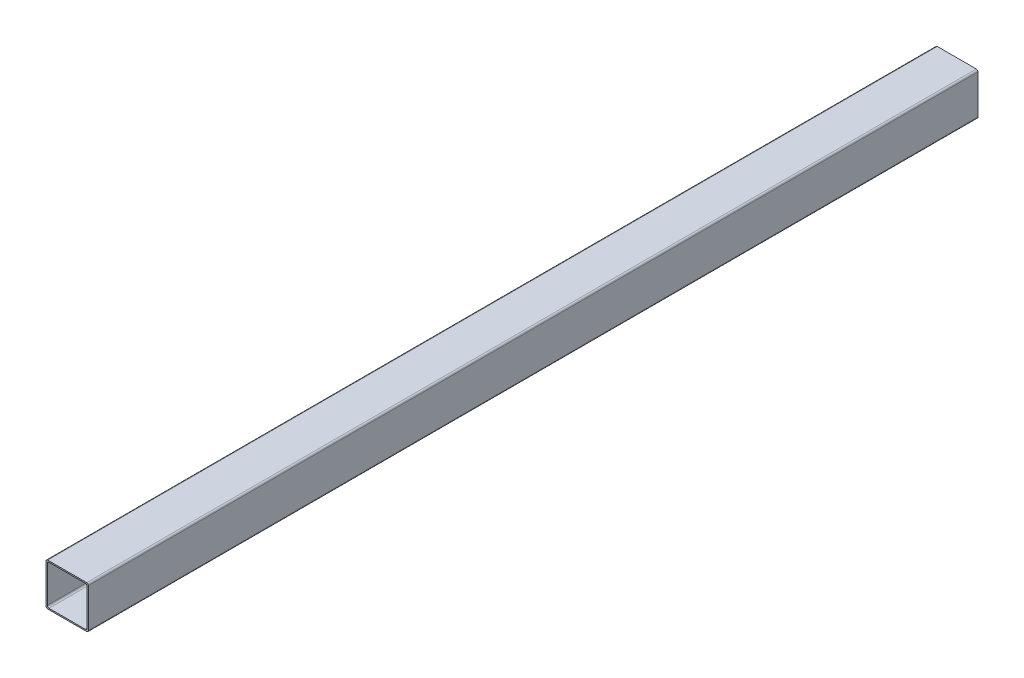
ISO-10303-21;
HEADER;
FILE_DESCRIPTION(('STEP AP214'),'2;1');
FILE_NAME('part.step','',(''),(''),'','','');
FILE_SCHEMA(('AUTOMOTIVE_DESIGN { 1 0 10303 214 1 1 1 1 }'));
ENDSEC;
DATA;
#1=APPLICATION_CONTEXT('core data for automotive mechanical design processes');
#2=APPLICATION_PROTOCOL_DEFINITION('international standard','automotive_design',2000,#1);
#3=PRODUCT_CONTEXT('',#1,'mechanical');
#4=PRODUCT('Part','Part','',(#3));
#5=PRODUCT_RELATED_PRODUCT_CATEGORY('part','',(#4));
#6=PRODUCT_DEFINITION_FORMATION('','',#4);
#7=PRODUCT_DEFINITION_CONTEXT('part definition',#1,'design');
#8=PRODUCT_DEFINITION('design','',#6,#7);
#9=PRODUCT_DEFINITION_SHAPE('','',#8);
#10=(LENGTH_UNIT() NAMED_UNIT(*) SI_UNIT(.MILLI.,.METRE.));
#11=(NAMED_UNIT(*) PLANE_ANGLE_UNIT() SI_UNIT($,.RADIAN.));
#12=(NAMED_UNIT(*) SI_UNIT($,.STERADIAN.) SOLID_ANGLE_UNIT());
#13=UNCERTAINTY_MEASURE_WITH_UNIT(LENGTH_MEASURE(1.E-05),#10,'distance_accuracy_value','');
#14=(GEOMETRIC_REPRESENTATION_CONTEXT(3) GLOBAL_UNCERTAINTY_ASSIGNED_CONTEXT((#13)) GLOBAL_UNIT_ASSIGNED_CONTEXT((#10,
#11,#12)) REPRESENTATION_CONTEXT('',''));
#15=CARTESIAN_POINT('',(0.,0.,0.));
#16=DIRECTION('',(0.,0.,1.));
#17=DIRECTION('',(1.,0.,0.));
#18=AXIS2_PLACEMENT_3D('',#15,#16,#17);
#19=CARTESIAN_POINT('',(0.,0.,2100.00000000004));
#20=DIRECTION('',(0.,0.,1.));
#21=DIRECTION('',(1.,0.,0.));
#22=AXIS2_PLACEMENT_3D('',#19,#20,#21);
#23=PLANE('',#22);
#24=DIRECTION('',(1.,0.,0.));
#25=VECTOR('',#24,1.);
#26=CARTESIAN_POINT('',(0.,0.,2100.00000000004));
#27=LINE('',#26,#25);
#28=CARTESIAN_POINT('',(4.,0.,2100.00000000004));
#29=VERTEX_POINT('',#28);
#30=CARTESIAN_POINT('',(96.,0.,2100.00000000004));
#31=VERTEX_POINT('',#30);
#32=EDGE_CURVE('E355',#29,#31,#27,.T.);
#33=ORIENTED_EDGE('',*,*,#32,.T.);
#34=CARTESIAN_POINT('',(96.,4.,2100.00000000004));
#35=DIRECTION('',(0.,0.,1.));
#36=DIRECTION('',(1.,0.,0.));
#37=AXIS2_PLACEMENT_3D('',#34,#35,#36);
#38=CIRCLE('',#37,4.);
#39=CARTESIAN_POINT('',(100.,4.,2100.00000000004));
#40=VERTEX_POINT('',#39);
#41=EDGE_CURVE('E256',#31,#40,#38,.T.);
#42=ORIENTED_EDGE('',*,*,#41,.T.);
#43=DIRECTION('',(0.,1.,0.));
#44=VECTOR('',#43,1.);
#45=CARTESIAN_POINT('',(100.,0.,2100.00000000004));
#46=LINE('',#45,#44);
#47=CARTESIAN_POINT('',(100.,96.,2100.00000000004));
#48=VERTEX_POINT('',#47);
#49=EDGE_CURVE('E217',#40,#48,#46,.T.);
#50=ORIENTED_EDGE('',*,*,#49,.T.);
#51=CARTESIAN_POINT('',(96.,96.,2100.00000000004));
#52=DIRECTION('',(0.,0.,1.));
#53=DIRECTION('',(1.,0.,0.));
#54=AXIS2_PLACEMENT_3D('',#51,#52,#53);
#55=CIRCLE('',#54,4.);
#56=CARTESIAN_POINT('',(96.,100.,2100.00000000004));
#57=VERTEX_POINT('',#56);
#58=EDGE_CURVE('E247',#48,#57,#55,.T.);
#59=ORIENTED_EDGE('',*,*,#58,.T.);
#60=DIRECTION('',(-1.,0.,0.));
#61=VECTOR('',#60,1.);
#62=CARTESIAN_POINT('',(0.,100.,2100.00000000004));
#63=LINE('',#62,#61);
#64=CARTESIAN_POINT('',(4.,100.,2100.00000000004));
#65=VERTEX_POINT('',#64);
#66=EDGE_CURVE('E236',#57,#65,#63,.T.);
#67=ORIENTED_EDGE('',*,*,#66,.T.);
#68=CARTESIAN_POINT('',(4.,96.,2100.00000000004));
#69=DIRECTION('',(0.,0.,1.));
#70=DIRECTION('',(1.,0.,0.));
#71=AXIS2_PLACEMENT_3D('',#68,#69,#70);
#72=CIRCLE('',#71,4.);
#73=CARTESIAN_POINT('',(0.,96.,2100.00000000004));
#74=VERTEX_POINT('',#73);
#75=EDGE_CURVE('E250',#65,#74,#72,.T.);
#76=ORIENTED_EDGE('',*,*,#75,.T.);
#77=DIRECTION('',(0.,-1.,0.));
#78=VECTOR('',#77,1.);
#79=CARTESIAN_POINT('',(0.,0.,2100.00000000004));
#80=LINE('',#79,#78);
#81=CARTESIAN_POINT('',(0.,4.,2100.00000000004));
#82=VERTEX_POINT('',#81);
#83=EDGE_CURVE('E229',#74,#82,#80,.T.);
#84=ORIENTED_EDGE('',*,*,#83,.T.);
#85=CARTESIAN_POINT('',(4.,4.,2100.00000000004));
#86=DIRECTION('',(0.,0.,1.));
#87=DIRECTION('',(1.,0.,0.));
#88=AXIS2_PLACEMENT_3D('',#85,#86,#87);
#89=CIRCLE('',#88,4.);
#90=EDGE_CURVE('E253',#82,#29,#89,.T.);
#91=ORIENTED_EDGE('',*,*,#90,.T.);
#92=EDGE_LOOP('',(#33,#42,#50,#59,#67,#76,#84,#91));
#93=FACE_BOUND('',#92,.T.);
#94=DIRECTION('',(1.,0.,0.));
#95=VECTOR('',#94,1.);
#96=CARTESIAN_POINT('',(0.,3.,2100.00000000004));
#97=LINE('',#96,#95);
#98=CARTESIAN_POINT('',(7.,3.,2100.00000000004));
#99=VERTEX_POINT('',#98);
#100=CARTESIAN_POINT('',(93.,3.,2100.00000000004));
#101=VERTEX_POINT('',#100);
#102=EDGE_CURVE('E342',#99,#101,#97,.T.);
#103=ORIENTED_EDGE('',*,*,#102,.F.);
#104=CARTESIAN_POINT('',(7.,7.00000000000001,2100.00000000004));
#105=DIRECTION('',(0.,0.,1.));
#106=DIRECTION('',(1.,0.,0.));
#107=AXIS2_PLACEMENT_3D('',#104,#105,#106);
#108=CIRCLE('',#107,4.);
#109=CARTESIAN_POINT('',(3.,7.00000000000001,2100.00000000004));
#110=VERTEX_POINT('',#109);
#111=EDGE_CURVE('E302',#99,#110,#108,.F.);
#112=ORIENTED_EDGE('',*,*,#111,.T.);
#113=DIRECTION('',(0.,-1.,0.));
#114=VECTOR('',#113,1.);
#115=CARTESIAN_POINT('',(3.,100.,2100.00000000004));
#116=LINE('',#115,#114);
#117=CARTESIAN_POINT('',(3.,93.,2100.00000000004));
#118=VERTEX_POINT('',#117);
#119=EDGE_CURVE('E333',#118,#110,#116,.T.);
#120=ORIENTED_EDGE('',*,*,#119,.F.);
#121=CARTESIAN_POINT('',(7.,93.,2100.00000000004));
#122=DIRECTION('',(0.,0.,1.));
#123=DIRECTION('',(1.,0.,0.));
#124=AXIS2_PLACEMENT_3D('',#121,#122,#123);
#125=CIRCLE('',#124,4.);
#126=CARTESIAN_POINT('',(7.,97.,2100.00000000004));
#127=VERTEX_POINT('',#126);
#128=EDGE_CURVE('E12',#118,#127,#125,.F.);
#129=ORIENTED_EDGE('',*,*,#128,.T.);
#130=DIRECTION('',(-1.,0.,0.));
#131=VECTOR('',#130,1.);
#132=CARTESIAN_POINT('',(0.,97.,2100.00000000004));
#133=LINE('',#132,#131);
#134=CARTESIAN_POINT('',(93.,97.,2100.00000000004));
#135=VERTEX_POINT('',#134);
#136=EDGE_CURVE('E332',#135,#127,#133,.T.);
#137=ORIENTED_EDGE('',*,*,#136,.F.);
#138=CARTESIAN_POINT('',(93.,93.,2100.00000000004));
#139=DIRECTION('',(0.,0.,1.));
#140=DIRECTION('',(1.,0.,0.));
#141=AXIS2_PLACEMENT_3D('',#138,#139,#140);
#142=CIRCLE('',#141,4.);
#143=CARTESIAN_POINT('',(97.,93.,2100.00000000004));
#144=VERTEX_POINT('',#143);
#145=EDGE_CURVE('E85',#135,#144,#142,.F.);
#146=ORIENTED_EDGE('',*,*,#145,.T.);
#147=DIRECTION('',(0.,1.,0.));
#148=VECTOR('',#147,1.);
#149=CARTESIAN_POINT('',(97.,100.,2100.00000000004));
#150=LINE('',#149,#148);
#151=CARTESIAN_POINT('',(97.,7.00000000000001,2100.00000000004));
#152=VERTEX_POINT('',#151);
#153=EDGE_CURVE('E338',#152,#144,#150,.T.);
#154=ORIENTED_EDGE('',*,*,#153,.F.);
#155=CARTESIAN_POINT('',(93.,7.,2100.00000000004));
#156=DIRECTION('',(0.,0.,1.));
#157=DIRECTION('',(1.,0.,0.));
#158=AXIS2_PLACEMENT_3D('',#155,#156,#157);
#159=CIRCLE('',#158,4.);
#160=EDGE_CURVE('E307',#152,#101,#159,.F.);
#161=ORIENTED_EDGE('',*,*,#160,.T.);
#162=EDGE_LOOP('',(#103,#112,#120,#129,#137,#146,#154,#161));
#163=FACE_BOUND('',#162,.T.);
#164=ADVANCED_FACE('F66',(#93,#163),#23,.T.);
#165=CARTESIAN_POINT('',(0.,0.,0.));
#166=DIRECTION('',(0.,0.,1.));
#167=DIRECTION('',(1.,0.,0.));
#168=AXIS2_PLACEMENT_3D('',#165,#166,#167);
#169=PLANE('',#168);
#170=DIRECTION('',(0.,1.,0.));
#171=VECTOR('',#170,1.);
#172=CARTESIAN_POINT('',(100.,0.,0.));
#173=LINE('',#172,#171);
#174=CARTESIAN_POINT('',(100.,4.,0.));
#175=VERTEX_POINT('',#174);
#176=CARTESIAN_POINT('',(100.,96.,0.));
#177=VERTEX_POINT('',#176);
#178=EDGE_CURVE('E214',#175,#177,#173,.T.);
#179=ORIENTED_EDGE('',*,*,#178,.F.);
#180=CARTESIAN_POINT('',(96.,4.,0.));
#181=DIRECTION('',(0.,0.,1.));
#182=DIRECTION('',(1.,0.,0.));
#183=AXIS2_PLACEMENT_3D('',#180,#181,#182);
#184=CIRCLE('',#183,4.);
#185=CARTESIAN_POINT('',(96.,0.,0.));
#186=VERTEX_POINT('',#185);
#187=EDGE_CURVE('E197',#175,#186,#184,.F.);
#188=ORIENTED_EDGE('',*,*,#187,.T.);
#189=DIRECTION('',(1.,0.,0.));
#190=VECTOR('',#189,1.);
#191=CARTESIAN_POINT('',(0.,0.,0.));
#192=LINE('',#191,#190);
#193=CARTESIAN_POINT('',(4.,0.,0.));
#194=VERTEX_POINT('',#193);
#195=EDGE_CURVE('E226',#194,#186,#192,.T.);
#196=ORIENTED_EDGE('',*,*,#195,.F.);
#197=CARTESIAN_POINT('',(4.,4.,0.));
#198=DIRECTION('',(0.,0.,1.));
#199=DIRECTION('',(1.,0.,0.));
#200=AXIS2_PLACEMENT_3D('',#197,#198,#199);
#201=CIRCLE('',#200,4.);
#202=CARTESIAN_POINT('',(0.,4.,0.));
#203=VERTEX_POINT('',#202);
#204=EDGE_CURVE('E208',#194,#203,#201,.F.);
#205=ORIENTED_EDGE('',*,*,#204,.T.);
#206=DIRECTION('',(0.,-1.,0.));
#207=VECTOR('',#206,1.);
#208=CARTESIAN_POINT('',(0.,0.,0.));
#209=LINE('',#208,#207);
#210=CARTESIAN_POINT('',(0.,96.,0.));
#211=VERTEX_POINT('',#210);
#212=EDGE_CURVE('E231',#211,#203,#209,.T.);
#213=ORIENTED_EDGE('',*,*,#212,.F.);
#214=CARTESIAN_POINT('',(4.,96.,0.));
#215=DIRECTION('',(0.,0.,1.));
#216=DIRECTION('',(1.,0.,0.));
#217=AXIS2_PLACEMENT_3D('',#214,#215,#216);
#218=CIRCLE('',#217,4.);
#219=CARTESIAN_POINT('',(4.,100.,0.));
#220=VERTEX_POINT('',#219);
#221=EDGE_CURVE('E239',#211,#220,#218,.F.);
#222=ORIENTED_EDGE('',*,*,#221,.T.);
#223=DIRECTION('',(-1.,0.,0.));
#224=VECTOR('',#223,1.);
#225=CARTESIAN_POINT('',(0.,100.,0.));
#226=LINE('',#225,#224);
#227=CARTESIAN_POINT('',(96.,100.,0.));
#228=VERTEX_POINT('',#227);
#229=EDGE_CURVE('E225',#228,#220,#226,.T.);
#230=ORIENTED_EDGE('',*,*,#229,.F.);
#231=CARTESIAN_POINT('',(96.,96.,0.));
#232=DIRECTION('',(0.,0.,1.));
#233=DIRECTION('',(1.,0.,0.));
#234=AXIS2_PLACEMENT_3D('',#231,#232,#233);
#235=CIRCLE('',#234,4.);
#236=EDGE_CURVE('E219',#228,#177,#235,.F.);
#237=ORIENTED_EDGE('',*,*,#236,.T.);
#238=EDGE_LOOP('',(#179,#188,#196,#205,#213,#222,#230,#237));
#239=FACE_BOUND('',#238,.T.);
#240=DIRECTION('',(-1.,0.,0.));
#241=VECTOR('',#240,1.);
#242=CARTESIAN_POINT('',(0.,97.,0.));
#243=LINE('',#242,#241);
#244=CARTESIAN_POINT('',(93.,97.,0.));
#245=VERTEX_POINT('',#244);
#246=CARTESIAN_POINT('',(7.,97.,0.));
#247=VERTEX_POINT('',#246);
#248=EDGE_CURVE('E318',#245,#247,#243,.T.);
#249=ORIENTED_EDGE('',*,*,#248,.T.);
#250=CARTESIAN_POINT('',(7.,93.,0.));
#251=DIRECTION('',(0.,0.,1.));
#252=DIRECTION('',(1.,0.,0.));
#253=AXIS2_PLACEMENT_3D('',#250,#251,#252);
#254=CIRCLE('',#253,4.);
#255=CARTESIAN_POINT('',(3.,93.,0.));
#256=VERTEX_POINT('',#255);
#257=EDGE_CURVE('E75',#247,#256,#254,.T.);
#258=ORIENTED_EDGE('',*,*,#257,.T.);
#259=DIRECTION('',(0.,-1.,0.));
#260=VECTOR('',#259,1.);
#261=CARTESIAN_POINT('',(3.,100.,0.));
#262=LINE('',#261,#260);
#263=CARTESIAN_POINT('',(3.,7.00000000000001,0.));
#264=VERTEX_POINT('',#263);
#265=EDGE_CURVE('E316',#256,#264,#262,.T.);
#266=ORIENTED_EDGE('',*,*,#265,.T.);
#267=CARTESIAN_POINT('',(7.,7.00000000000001,0.));
#268=DIRECTION('',(0.,0.,1.));
#269=DIRECTION('',(1.,0.,0.));
#270=AXIS2_PLACEMENT_3D('',#267,#268,#269);
#271=CIRCLE('',#270,4.);
#272=CARTESIAN_POINT('',(7.,3.,0.));
#273=VERTEX_POINT('',#272);
#274=EDGE_CURVE('E300',#264,#273,#271,.T.);
#275=ORIENTED_EDGE('',*,*,#274,.T.);
#276=DIRECTION('',(1.,0.,0.));
#277=VECTOR('',#276,1.);
#278=CARTESIAN_POINT('',(0.,3.,0.));
#279=LINE('',#278,#277);
#280=CARTESIAN_POINT('',(93.,3.,0.));
#281=VERTEX_POINT('',#280);
#282=EDGE_CURVE('E327',#273,#281,#279,.T.);
#283=ORIENTED_EDGE('',*,*,#282,.T.);
#284=CARTESIAN_POINT('',(93.,7.,0.));
#285=DIRECTION('',(0.,0.,1.));
#286=DIRECTION('',(1.,0.,0.));
#287=AXIS2_PLACEMENT_3D('',#284,#285,#286);
#288=CIRCLE('',#287,4.);
#289=CARTESIAN_POINT('',(97.,7.00000000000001,0.));
#290=VERTEX_POINT('',#289);
#291=EDGE_CURVE('E305',#281,#290,#288,.T.);
#292=ORIENTED_EDGE('',*,*,#291,.T.);
#293=DIRECTION('',(0.,1.,0.));
#294=VECTOR('',#293,1.);
#295=CARTESIAN_POINT('',(97.,100.,0.));
#296=LINE('',#295,#294);
#297=CARTESIAN_POINT('',(97.,93.,0.));
#298=VERTEX_POINT('',#297);
#299=EDGE_CURVE('E348',#290,#298,#296,.T.);
#300=ORIENTED_EDGE('',*,*,#299,.T.);
#301=CARTESIAN_POINT('',(93.,93.,0.));
#302=DIRECTION('',(0.,0.,1.));
#303=DIRECTION('',(1.,0.,0.));
#304=AXIS2_PLACEMENT_3D('',#301,#302,#303);
#305=CIRCLE('',#304,4.);
#306=EDGE_CURVE('E310',#298,#245,#305,.T.);
#307=ORIENTED_EDGE('',*,*,#306,.T.);
#308=EDGE_LOOP('',(#249,#258,#266,#275,#283,#292,#300,#307));
#309=FACE_BOUND('',#308,.T.);
#310=ADVANCED_FACE('F222',(#239,#309),#169,.F.);
#311=CARTESIAN_POINT('',(0.,0.,2100.00000000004));
#312=DIRECTION('',(1.,0.,0.));
#313=DIRECTION('',(0.,0.,-1.));
#314=AXIS2_PLACEMENT_3D('',#311,#312,#313);
#315=PLANE('',#314);
#316=ORIENTED_EDGE('',*,*,#212,.T.);
#317=DIRECTION('',(0.,0.,-1.));
#318=VECTOR('',#317,1.);
#319=CARTESIAN_POINT('',(0.,4.,2100.00000000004));
#320=LINE('',#319,#318);
#321=EDGE_CURVE('E263',#203,#82,#320,.F.);
#322=ORIENTED_EDGE('',*,*,#321,.T.);
#323=ORIENTED_EDGE('',*,*,#83,.F.);
#324=DIRECTION('',(0.,0.,-1.));
#325=VECTOR('',#324,1.);
#326=CARTESIAN_POINT('',(0.,96.,2100.00000000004));
#327=LINE('',#326,#325);
#328=EDGE_CURVE('E259',#74,#211,#327,.T.);
#329=ORIENTED_EDGE('',*,*,#328,.T.);
#330=EDGE_LOOP('',(#316,#322,#323,#329));
#331=FACE_BOUND('',#330,.T.);
#332=ADVANCED_FACE('F376',(#331),#315,.F.);
#333=CARTESIAN_POINT('',(0.,0.,2100.00000000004));
#334=DIRECTION('',(0.,1.,0.));
#335=DIRECTION('',(0.,0.,1.));
#336=AXIS2_PLACEMENT_3D('',#333,#334,#335);
#337=PLANE('',#336);
#338=ORIENTED_EDGE('',*,*,#195,.T.);
#339=DIRECTION('',(0.,0.,-1.));
#340=VECTOR('',#339,1.);
#341=CARTESIAN_POINT('',(96.,0.,2100.00000000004));
#342=LINE('',#341,#340);
#343=EDGE_CURVE('E202',#186,#31,#342,.F.);
#344=ORIENTED_EDGE('',*,*,#343,.T.);
#345=ORIENTED_EDGE('',*,*,#32,.F.);
#346=DIRECTION('',(0.,0.,-1.));
#347=VECTOR('',#346,1.);
#348=CARTESIAN_POINT('',(4.,0.,2100.00000000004));
#349=LINE('',#348,#347);
#350=EDGE_CURVE('E207',#29,#194,#349,.T.);
#351=ORIENTED_EDGE('',*,*,#350,.T.);
#352=EDGE_LOOP('',(#338,#344,#345,#351));
#353=FACE_BOUND('',#352,.T.);
#354=ADVANCED_FACE('F384',(#353),#337,.F.);
#355=CARTESIAN_POINT('',(100.,0.,2100.00000000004));
#356=DIRECTION('',(-1.,0.,0.));
#357=DIRECTION('',(0.,0.,1.));
#358=AXIS2_PLACEMENT_3D('',#355,#356,#357);
#359=PLANE('',#358);
#360=ORIENTED_EDGE('',*,*,#49,.F.);
#361=DIRECTION('',(0.,0.,-1.));
#362=VECTOR('',#361,1.);
#363=CARTESIAN_POINT('',(100.,4.,2100.00000000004));
#364=LINE('',#363,#362);
#365=EDGE_CURVE('E201',#40,#175,#364,.T.);
#366=ORIENTED_EDGE('',*,*,#365,.T.);
#367=ORIENTED_EDGE('',*,*,#178,.T.);
#368=DIRECTION('',(0.,0.,-1.));
#369=VECTOR('',#368,1.);
#370=CARTESIAN_POINT('',(100.,96.,2100.00000000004));
#371=LINE('',#370,#369);
#372=EDGE_CURVE('E220',#177,#48,#371,.F.);
#373=ORIENTED_EDGE('',*,*,#372,.T.);
#374=EDGE_LOOP('',(#360,#366,#367,#373));
#375=FACE_BOUND('',#374,.T.);
#376=ADVANCED_FACE('F213',(#375),#359,.F.);
#377=CARTESIAN_POINT('',(0.,100.,2100.00000000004));
#378=DIRECTION('',(0.,-1.,0.));
#379=DIRECTION('',(0.,0.,-1.));
#380=AXIS2_PLACEMENT_3D('',#377,#378,#379);
#381=PLANE('',#380);
#382=ORIENTED_EDGE('',*,*,#229,.T.);
#383=DIRECTION('',(0.,0.,-1.));
#384=VECTOR('',#383,1.);
#385=CARTESIAN_POINT('',(4.,100.,2100.00000000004));
#386=LINE('',#385,#384);
#387=EDGE_CURVE('E270',#220,#65,#386,.F.);
#388=ORIENTED_EDGE('',*,*,#387,.T.);
#389=ORIENTED_EDGE('',*,*,#66,.F.);
#390=DIRECTION('',(0.,0.,-1.));
#391=VECTOR('',#390,1.);
#392=CARTESIAN_POINT('',(96.,100.,2100.00000000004));
#393=LINE('',#392,#391);
#394=EDGE_CURVE('E266',#57,#228,#393,.T.);
#395=ORIENTED_EDGE('',*,*,#394,.T.);
#396=EDGE_LOOP('',(#382,#388,#389,#395));
#397=FACE_BOUND('',#396,.T.);
#398=ADVANCED_FACE('F387',(#397),#381,.F.);
#399=CARTESIAN_POINT('',(3.,100.,2100.00000000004));
#400=DIRECTION('',(1.,0.,0.));
#401=DIRECTION('',(0.,0.,-1.));
#402=AXIS2_PLACEMENT_3D('',#399,#400,#401);
#403=PLANE('',#402);
#404=ORIENTED_EDGE('',*,*,#119,.T.);
#405=DIRECTION('',(0.,0.,-1.));
#406=VECTOR('',#405,1.);
#407=CARTESIAN_POINT('',(3.,7.00000000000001,0.));
#408=LINE('',#407,#406);
#409=EDGE_CURVE('E276',#110,#264,#408,.T.);
#410=ORIENTED_EDGE('',*,*,#409,.T.);
#411=ORIENTED_EDGE('',*,*,#265,.F.);
#412=DIRECTION('',(0.,0.,-1.));
#413=VECTOR('',#412,1.);
#414=CARTESIAN_POINT('',(3.,93.,2100.00000000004));
#415=LINE('',#414,#413);
#416=EDGE_CURVE('E273',#256,#118,#415,.F.);
#417=ORIENTED_EDGE('',*,*,#416,.T.);
#418=EDGE_LOOP('',(#404,#410,#411,#417));
#419=FACE_BOUND('',#418,.T.);
#420=ADVANCED_FACE('F324',(#419),#403,.T.);
#421=CARTESIAN_POINT('',(0.,3.,2100.00000000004));
#422=DIRECTION('',(0.,1.,0.));
#423=DIRECTION('',(0.,0.,1.));
#424=AXIS2_PLACEMENT_3D('',#421,#422,#423);
#425=PLANE('',#424);
#426=ORIENTED_EDGE('',*,*,#282,.F.);
#427=DIRECTION('',(0.,0.,-1.));
#428=VECTOR('',#427,1.);
#429=CARTESIAN_POINT('',(7.,3.,2100.00000000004));
#430=LINE('',#429,#428);
#431=EDGE_CURVE('E284',#273,#99,#430,.F.);
#432=ORIENTED_EDGE('',*,*,#431,.T.);
#433=ORIENTED_EDGE('',*,*,#102,.T.);
#434=DIRECTION('',(0.,0.,-1.));
#435=VECTOR('',#434,1.);
#436=CARTESIAN_POINT('',(93.,3.,0.));
#437=LINE('',#436,#435);
#438=EDGE_CURVE('E280',#101,#281,#437,.T.);
#439=ORIENTED_EDGE('',*,*,#438,.T.);
#440=EDGE_LOOP('',(#426,#432,#433,#439));
#441=FACE_BOUND('',#440,.T.);
#442=ADVANCED_FACE('F394',(#441),#425,.T.);
#443=CARTESIAN_POINT('',(97.,100.,2100.00000000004));
#444=DIRECTION('',(-1.,0.,0.));
#445=DIRECTION('',(0.,0.,1.));
#446=AXIS2_PLACEMENT_3D('',#443,#444,#445);
#447=PLANE('',#446);
#448=ORIENTED_EDGE('',*,*,#299,.F.);
#449=DIRECTION('',(0.,0.,-1.));
#450=VECTOR('',#449,1.);
#451=CARTESIAN_POINT('',(97.,7.,2100.00000000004));
#452=LINE('',#451,#450);
#453=EDGE_CURVE('E95',#290,#152,#452,.F.);
#454=ORIENTED_EDGE('',*,*,#453,.T.);
#455=ORIENTED_EDGE('',*,*,#153,.T.);
#456=DIRECTION('',(0.,0.,-1.));
#457=VECTOR('',#456,1.);
#458=CARTESIAN_POINT('',(97.,93.,0.));
#459=LINE('',#458,#457);
#460=EDGE_CURVE('E287',#144,#298,#459,.T.);
#461=ORIENTED_EDGE('',*,*,#460,.T.);
#462=EDGE_LOOP('',(#448,#454,#455,#461));
#463=FACE_BOUND('',#462,.T.);
#464=ADVANCED_FACE('F406',(#463),#447,.T.);
#465=CARTESIAN_POINT('',(0.,97.,2100.00000000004));
#466=DIRECTION('',(0.,-1.,0.));
#467=DIRECTION('',(0.,0.,-1.));
#468=AXIS2_PLACEMENT_3D('',#465,#466,#467);
#469=PLANE('',#468);
#470=ORIENTED_EDGE('',*,*,#248,.F.);
#471=DIRECTION('',(0.,0.,-1.));
#472=VECTOR('',#471,1.);
#473=CARTESIAN_POINT('',(93.,97.,2100.00000000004));
#474=LINE('',#473,#472);
#475=EDGE_CURVE('E297',#245,#135,#474,.F.);
#476=ORIENTED_EDGE('',*,*,#475,.T.);
#477=ORIENTED_EDGE('',*,*,#136,.T.);
#478=DIRECTION('',(0.,0.,-1.));
#479=VECTOR('',#478,1.);
#480=CARTESIAN_POINT('',(7.,97.,0.));
#481=LINE('',#480,#479);
#482=EDGE_CURVE('E293',#127,#247,#481,.T.);
#483=ORIENTED_EDGE('',*,*,#482,.T.);
#484=EDGE_LOOP('',(#470,#476,#477,#483));
#485=FACE_BOUND('',#484,.T.);
#486=ADVANCED_FACE('F335',(#485),#469,.T.);
#487=CARTESIAN_POINT('',(96.,4.,2100.00000000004));
#488=DIRECTION('',(0.,0.,-1.));
#489=DIRECTION('',(-1.,0.,0.));
#490=AXIS2_PLACEMENT_3D('',#487,#488,#489);
#491=CYLINDRICAL_SURFACE('',#490,4.);
#492=ORIENTED_EDGE('',*,*,#41,.F.);
#493=ORIENTED_EDGE('',*,*,#343,.F.);
#494=ORIENTED_EDGE('',*,*,#187,.F.);
#495=ORIENTED_EDGE('',*,*,#365,.F.);
#496=EDGE_LOOP('',(#492,#493,#494,#495));
#497=FACE_BOUND('',#496,.T.);
#498=ADVANCED_FACE('F200',(#497),#491,.T.);
#499=CARTESIAN_POINT('',(4.,4.,2100.00000000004));
#500=DIRECTION('',(0.,0.,-1.));
#501=DIRECTION('',(-1.,0.,0.));
#502=AXIS2_PLACEMENT_3D('',#499,#500,#501);
#503=CYLINDRICAL_SURFACE('',#502,4.);
#504=ORIENTED_EDGE('',*,*,#90,.F.);
#505=ORIENTED_EDGE('',*,*,#321,.F.);
#506=ORIENTED_EDGE('',*,*,#204,.F.);
#507=ORIENTED_EDGE('',*,*,#350,.F.);
#508=EDGE_LOOP('',(#504,#505,#506,#507));
#509=FACE_BOUND('',#508,.T.);
#510=ADVANCED_FACE('F381',(#509),#503,.T.);
#511=CARTESIAN_POINT('',(4.,96.,2100.00000000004));
#512=DIRECTION('',(0.,0.,-1.));
#513=DIRECTION('',(-1.,0.,0.));
#514=AXIS2_PLACEMENT_3D('',#511,#512,#513);
#515=CYLINDRICAL_SURFACE('',#514,4.);
#516=ORIENTED_EDGE('',*,*,#75,.F.);
#517=ORIENTED_EDGE('',*,*,#387,.F.);
#518=ORIENTED_EDGE('',*,*,#221,.F.);
#519=ORIENTED_EDGE('',*,*,#328,.F.);
#520=EDGE_LOOP('',(#516,#517,#518,#519));
#521=FACE_BOUND('',#520,.T.);
#522=ADVANCED_FACE('F373',(#521),#515,.T.);
#523=CARTESIAN_POINT('',(96.,96.,2100.00000000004));
#524=DIRECTION('',(0.,0.,-1.));
#525=DIRECTION('',(-1.,0.,0.));
#526=AXIS2_PLACEMENT_3D('',#523,#524,#525);
#527=CYLINDRICAL_SURFACE('',#526,4.);
#528=ORIENTED_EDGE('',*,*,#58,.F.);
#529=ORIENTED_EDGE('',*,*,#372,.F.);
#530=ORIENTED_EDGE('',*,*,#236,.F.);
#531=ORIENTED_EDGE('',*,*,#394,.F.);
#532=EDGE_LOOP('',(#528,#529,#530,#531));
#533=FACE_BOUND('',#532,.T.);
#534=ADVANCED_FACE('F386',(#533),#527,.T.);
#535=CARTESIAN_POINT('',(7.,7.00000000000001,2100.00000000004));
#536=DIRECTION('',(0.,0.,1.));
#537=DIRECTION('',(1.,0.,0.));
#538=AXIS2_PLACEMENT_3D('',#535,#536,#537);
#539=CYLINDRICAL_SURFACE('',#538,4.);
#540=ORIENTED_EDGE('',*,*,#111,.F.);
#541=ORIENTED_EDGE('',*,*,#431,.F.);
#542=ORIENTED_EDGE('',*,*,#274,.F.);
#543=ORIENTED_EDGE('',*,*,#409,.F.);
#544=EDGE_LOOP('',(#540,#541,#542,#543));
#545=FACE_BOUND('',#544,.T.);
#546=ADVANCED_FACE('F426',(#545),#539,.F.);
#547=CARTESIAN_POINT('',(93.,7.,2100.00000000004));
#548=DIRECTION('',(0.,0.,1.));
#549=DIRECTION('',(1.,0.,0.));
#550=AXIS2_PLACEMENT_3D('',#547,#548,#549);
#551=CYLINDRICAL_SURFACE('',#550,4.);
#552=ORIENTED_EDGE('',*,*,#160,.F.);
#553=ORIENTED_EDGE('',*,*,#453,.F.);
#554=ORIENTED_EDGE('',*,*,#291,.F.);
#555=ORIENTED_EDGE('',*,*,#438,.F.);
#556=EDGE_LOOP('',(#552,#553,#554,#555));
#557=FACE_BOUND('',#556,.T.);
#558=ADVANCED_FACE('F429',(#557),#551,.F.);
#559=CARTESIAN_POINT('',(93.,93.,2100.00000000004));
#560=DIRECTION('',(0.,0.,1.));
#561=DIRECTION('',(1.,0.,0.));
#562=AXIS2_PLACEMENT_3D('',#559,#560,#561);
#563=CYLINDRICAL_SURFACE('',#562,4.);
#564=ORIENTED_EDGE('',*,*,#145,.F.);
#565=ORIENTED_EDGE('',*,*,#475,.F.);
#566=ORIENTED_EDGE('',*,*,#306,.F.);
#567=ORIENTED_EDGE('',*,*,#460,.F.);
#568=EDGE_LOOP('',(#564,#565,#566,#567));
#569=FACE_BOUND('',#568,.T.);
#570=ADVANCED_FACE('F432',(#569),#563,.F.);
#571=CARTESIAN_POINT('',(7.,93.,2100.00000000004));
#572=DIRECTION('',(0.,0.,1.));
#573=DIRECTION('',(1.,0.,0.));
#574=AXIS2_PLACEMENT_3D('',#571,#572,#573);
#575=CYLINDRICAL_SURFACE('',#574,4.);
#576=ORIENTED_EDGE('',*,*,#128,.F.);
#577=ORIENTED_EDGE('',*,*,#416,.F.);
#578=ORIENTED_EDGE('',*,*,#257,.F.);
#579=ORIENTED_EDGE('',*,*,#482,.F.);
#580=EDGE_LOOP('',(#576,#577,#578,#579));
#581=FACE_BOUND('',#580,.T.);
#582=ADVANCED_FACE('F68',(#581),#575,.F.);
#583=CLOSED_SHELL('',(#164,#310,#332,#354,#376,#398,#420,#442,#464,#486,#498,#510,#522,#534,
#546,#558,#570,#582));
#584=MANIFOLD_SOLID_BREP('B2',#583);
#585=ADVANCED_BREP_SHAPE_REPRESENTATION('',(#18,#584),#14);
#586=SHAPE_DEFINITION_REPRESENTATION(#9,#585);
ENDSEC;
END-ISO-10303-21;
